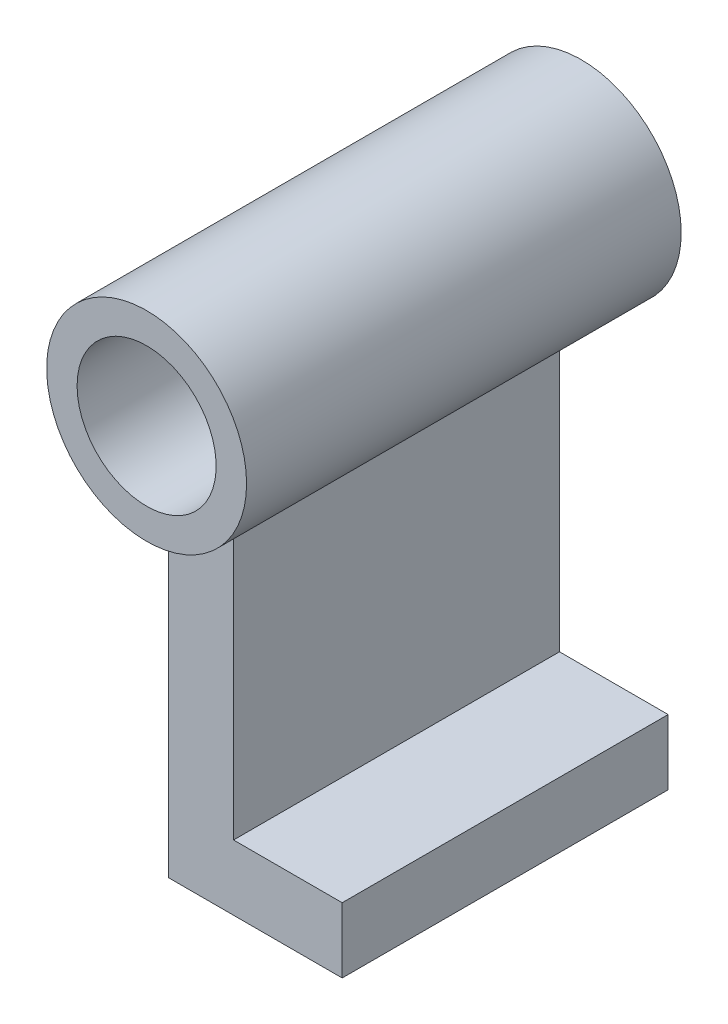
ISO-10303-21;
HEADER;
FILE_DESCRIPTION(('STEP AP214'),'2;1');
FILE_NAME('part.step','',(''),(''),'','','');
FILE_SCHEMA(('AUTOMOTIVE_DESIGN { 1 0 10303 214 1 1 1 1 }'));
ENDSEC;
DATA;
#1=APPLICATION_CONTEXT('core data for automotive mechanical design processes');
#2=APPLICATION_PROTOCOL_DEFINITION('international standard','automotive_design',2000,#1);
#3=PRODUCT_CONTEXT('',#1,'mechanical');
#4=PRODUCT('Part','Part','',(#3));
#5=PRODUCT_RELATED_PRODUCT_CATEGORY('part','',(#4));
#6=PRODUCT_DEFINITION_FORMATION('','',#4);
#7=PRODUCT_DEFINITION_CONTEXT('part definition',#1,'design');
#8=PRODUCT_DEFINITION('design','',#6,#7);
#9=PRODUCT_DEFINITION_SHAPE('','',#8);
#10=(LENGTH_UNIT() NAMED_UNIT(*) SI_UNIT(.MILLI.,.METRE.));
#11=(NAMED_UNIT(*) PLANE_ANGLE_UNIT() SI_UNIT($,.RADIAN.));
#12=(NAMED_UNIT(*) SI_UNIT($,.STERADIAN.) SOLID_ANGLE_UNIT());
#13=UNCERTAINTY_MEASURE_WITH_UNIT(LENGTH_MEASURE(1.E-05),#10,'distance_accuracy_value','');
#14=(GEOMETRIC_REPRESENTATION_CONTEXT(3) GLOBAL_UNCERTAINTY_ASSIGNED_CONTEXT((#13)) GLOBAL_UNIT_ASSIGNED_CONTEXT((#10,
#11,#12)) REPRESENTATION_CONTEXT('',''));
#15=CARTESIAN_POINT('',(0.,0.,0.));
#16=DIRECTION('',(0.,0.,1.));
#17=DIRECTION('',(1.,0.,0.));
#18=AXIS2_PLACEMENT_3D('',#15,#16,#17);
#19=CARTESIAN_POINT('',(0.,0.,50.));
#20=DIRECTION('',(0.,0.,-1.));
#21=DIRECTION('',(-1.,0.,0.));
#22=AXIS2_PLACEMENT_3D('',#19,#20,#21);
#23=CYLINDRICAL_SURFACE('',#22,23.);
#24=DIRECTION('',(0.,0.,-1.));
#25=VECTOR('',#24,1.);
#26=CARTESIAN_POINT('',(-7.5,-21.7428149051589,37.5));
#27=LINE('',#26,#25);
#28=CARTESIAN_POINT('',(-7.5,-21.7428149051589,37.5));
#29=VERTEX_POINT('',#28);
#30=CARTESIAN_POINT('',(-7.5,-21.7428149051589,-37.5));
#31=VERTEX_POINT('',#30);
#32=EDGE_CURVE('E58',#29,#31,#27,.T.);
#33=ORIENTED_EDGE('',*,*,#32,.F.);
#34=CARTESIAN_POINT('',(0.,0.,37.5));
#35=DIRECTION('',(0.,0.,1.));
#36=DIRECTION('',(1.,0.,0.));
#37=AXIS2_PLACEMENT_3D('',#34,#35,#36);
#38=CIRCLE('',#37,23.);
#39=CARTESIAN_POINT('',(7.5,-21.7428149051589,37.5));
#40=VERTEX_POINT('',#39);
#41=EDGE_CURVE('E63',#29,#40,#38,.T.);
#42=ORIENTED_EDGE('',*,*,#41,.T.);
#43=DIRECTION('',(0.,0.,-1.));
#44=VECTOR('',#43,1.);
#45=CARTESIAN_POINT('',(7.5,-21.7428149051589,37.5));
#46=LINE('',#45,#44);
#47=CARTESIAN_POINT('',(7.5,-21.7428149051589,-37.5));
#48=VERTEX_POINT('',#47);
#49=EDGE_CURVE('E124',#40,#48,#46,.T.);
#50=ORIENTED_EDGE('',*,*,#49,.T.);
#51=CARTESIAN_POINT('',(0.,0.,-37.5));
#52=DIRECTION('',(0.,0.,1.));
#53=DIRECTION('',(1.,0.,0.));
#54=AXIS2_PLACEMENT_3D('',#51,#52,#53);
#55=CIRCLE('',#54,23.);
#56=EDGE_CURVE('E125',#31,#48,#55,.T.);
#57=ORIENTED_EDGE('',*,*,#56,.F.);
#58=EDGE_LOOP('',(#33,#42,#50,#57));
#59=FACE_BOUND('',#58,.T.);
#60=CARTESIAN_POINT('',(0.,0.,50.));
#61=DIRECTION('',(0.,0.,1.));
#62=DIRECTION('',(1.,0.,0.));
#63=AXIS2_PLACEMENT_3D('',#60,#61,#62);
#64=CIRCLE('',#63,23.);
#65=CARTESIAN_POINT('',(23.,0.,50.));
#66=VERTEX_POINT('',#65);
#67=EDGE_CURVE('E50',#66,#66,#64,.T.);
#68=ORIENTED_EDGE('',*,*,#67,.F.);
#69=EDGE_LOOP('',(#68));
#70=FACE_BOUND('',#69,.T.);
#71=CARTESIAN_POINT('',(0.,0.,-50.));
#72=DIRECTION('',(0.,0.,1.));
#73=DIRECTION('',(1.,0.,0.));
#74=AXIS2_PLACEMENT_3D('',#71,#72,#73);
#75=CIRCLE('',#74,23.);
#76=CARTESIAN_POINT('',(23.,0.,-50.));
#77=VERTEX_POINT('',#76);
#78=EDGE_CURVE('E147',#77,#77,#75,.T.);
#79=ORIENTED_EDGE('',*,*,#78,.T.);
#80=EDGE_LOOP('',(#79));
#81=FACE_BOUND('',#80,.T.);
#82=ADVANCED_FACE('F42',(#59,#70,#81),#23,.T.);
#83=CARTESIAN_POINT('',(0.,0.,50.));
#84=DIRECTION('',(0.,0.,-1.));
#85=DIRECTION('',(-1.,0.,0.));
#86=AXIS2_PLACEMENT_3D('',#83,#84,#85);
#87=CYLINDRICAL_SURFACE('',#86,16.);
#88=CARTESIAN_POINT('',(0.,0.,50.));
#89=DIRECTION('',(0.,0.,1.));
#90=DIRECTION('',(1.,0.,0.));
#91=AXIS2_PLACEMENT_3D('',#88,#89,#90);
#92=CIRCLE('',#91,16.);
#93=CARTESIAN_POINT('',(-16.,0.,50.));
#94=VERTEX_POINT('',#93);
#95=EDGE_CURVE('E11',#94,#94,#92,.T.);
#96=CARTESIAN_POINT('',(0.,0.,-50.));
#97=DIRECTION('',(0.,0.,1.));
#98=DIRECTION('',(1.,0.,0.));
#99=AXIS2_PLACEMENT_3D('',#96,#97,#98);
#100=CIRCLE('',#99,16.);
#101=CARTESIAN_POINT('',(-16.,0.,-50.));
#102=VERTEX_POINT('',#101);
#103=EDGE_CURVE('E45',#102,#102,#100,.T.);
#104=CARTESIAN_POINT('',(-16.,0.,50.));
#105=CARTESIAN_POINT('',(-16.,0.,48.9583333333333));
#106=CARTESIAN_POINT('',(-16.,0.,47.9166666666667));
#107=CARTESIAN_POINT('',(-16.,0.,45.8333333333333));
#108=CARTESIAN_POINT('',(-16.,0.,44.7916666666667));
#109=CARTESIAN_POINT('',(-16.,0.,42.7083333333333));
#110=CARTESIAN_POINT('',(-16.,0.,41.6666666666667));
#111=CARTESIAN_POINT('',(-16.,0.,39.5833333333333));
#112=CARTESIAN_POINT('',(-16.,0.,38.5416666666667));
#113=CARTESIAN_POINT('',(-16.,0.,36.4583333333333));
#114=CARTESIAN_POINT('',(-16.,0.,35.4166666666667));
#115=CARTESIAN_POINT('',(-16.,0.,33.3333333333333));
#116=CARTESIAN_POINT('',(-16.,0.,32.2916666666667));
#117=CARTESIAN_POINT('',(-16.,0.,30.2083333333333));
#118=CARTESIAN_POINT('',(-16.,0.,29.1666666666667));
#119=CARTESIAN_POINT('',(-16.,0.,27.0833333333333));
#120=CARTESIAN_POINT('',(-16.,0.,26.0416666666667));
#121=CARTESIAN_POINT('',(-16.,0.,23.9583333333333));
#122=CARTESIAN_POINT('',(-16.,0.,22.9166666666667));
#123=CARTESIAN_POINT('',(-16.,0.,20.8333333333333));
#124=CARTESIAN_POINT('',(-16.,0.,19.7916666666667));
#125=CARTESIAN_POINT('',(-16.,0.,17.7083333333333));
#126=CARTESIAN_POINT('',(-16.,0.,16.6666666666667));
#127=CARTESIAN_POINT('',(-16.,0.,14.5833333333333));
#128=CARTESIAN_POINT('',(-16.,0.,13.5416666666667));
#129=CARTESIAN_POINT('',(-16.,0.,11.4583333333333));
#130=CARTESIAN_POINT('',(-16.,0.,10.4166666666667));
#131=CARTESIAN_POINT('',(-16.,0.,8.33333333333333));
#132=CARTESIAN_POINT('',(-16.,0.,7.29166666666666));
#133=CARTESIAN_POINT('',(-16.,0.,5.20833333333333));
#134=CARTESIAN_POINT('',(-16.,0.,4.16666666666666));
#135=CARTESIAN_POINT('',(-16.,0.,2.08333333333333));
#136=CARTESIAN_POINT('',(-16.,0.,1.04166666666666));
#137=CARTESIAN_POINT('',(-16.,0.,-1.04166666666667));
#138=CARTESIAN_POINT('',(-16.,0.,-2.08333333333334));
#139=CARTESIAN_POINT('',(-16.,0.,-4.16666666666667));
#140=CARTESIAN_POINT('',(-16.,0.,-5.20833333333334));
#141=CARTESIAN_POINT('',(-16.,0.,-7.29166666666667));
#142=CARTESIAN_POINT('',(-16.,0.,-8.33333333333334));
#143=CARTESIAN_POINT('',(-16.,0.,-10.4166666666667));
#144=CARTESIAN_POINT('',(-16.,0.,-11.4583333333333));
#145=CARTESIAN_POINT('',(-16.,0.,-13.5416666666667));
#146=CARTESIAN_POINT('',(-16.,0.,-14.5833333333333));
#147=CARTESIAN_POINT('',(-16.,0.,-16.6666666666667));
#148=CARTESIAN_POINT('',(-16.,0.,-17.7083333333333));
#149=CARTESIAN_POINT('',(-16.,0.,-19.7916666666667));
#150=CARTESIAN_POINT('',(-16.,0.,-20.8333333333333));
#151=CARTESIAN_POINT('',(-16.,0.,-22.9166666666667));
#152=CARTESIAN_POINT('',(-16.,0.,-23.9583333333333));
#153=CARTESIAN_POINT('',(-16.,0.,-26.0416666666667));
#154=CARTESIAN_POINT('',(-16.,0.,-27.0833333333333));
#155=CARTESIAN_POINT('',(-16.,0.,-29.1666666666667));
#156=CARTESIAN_POINT('',(-16.,0.,-30.2083333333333));
#157=CARTESIAN_POINT('',(-16.,0.,-32.2916666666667));
#158=CARTESIAN_POINT('',(-16.,0.,-33.3333333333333));
#159=CARTESIAN_POINT('',(-16.,0.,-35.4166666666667));
#160=CARTESIAN_POINT('',(-16.,0.,-36.4583333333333));
#161=CARTESIAN_POINT('',(-16.,0.,-38.5416666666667));
#162=CARTESIAN_POINT('',(-16.,0.,-39.5833333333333));
#163=CARTESIAN_POINT('',(-16.,0.,-41.6666666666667));
#164=CARTESIAN_POINT('',(-16.,0.,-42.7083333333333));
#165=CARTESIAN_POINT('',(-16.,0.,-44.7916666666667));
#166=CARTESIAN_POINT('',(-16.,0.,-45.8333333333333));
#167=CARTESIAN_POINT('',(-16.,0.,-47.9166666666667));
#168=CARTESIAN_POINT('',(-16.,0.,-48.9583333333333));
#169=CARTESIAN_POINT('',(-16.,0.,-50.));
#170=B_SPLINE_CURVE_WITH_KNOTS('',3,(#104,#105,#106,#107,#108,#109,#110,#111,#112,#113,#114,
#115,#116,#117,#118,#119,#120,#121,#122,#123,#124,#125,#126,#127,#128,#129,#130,#131,#132,#133,
#134,#135,#136,#137,#138,#139,#140,#141,#142,#143,#144,#145,#146,#147,#148,#149,#150,#151,#152,
#153,#154,#155,#156,#157,#158,#159,#160,#161,#162,#163,#164,#165,#166,#167,#168,#169),
.UNSPECIFIED.,.F.,.F.,(4,2,2,2,2,2,2,2,2,2,2,2,2,2,2,2,2,2,2,2,2,2,2,2,2,2,2,2,2,2,2,2,4),(0.,
3.125,6.25,9.37499999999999,12.5,15.625,18.75,21.875,25.,28.125,31.25,34.375,37.5,40.625,43.75,
46.875,50.,53.125,56.25,59.375,62.5,65.625,68.75,71.875,75.,78.125,81.25,84.375,87.5,90.625,
93.75,96.875,100.),.UNSPECIFIED.);
#171=EDGE_CURVE('BSEAM157',#94,#102,#170,.T.);
#172=ORIENTED_EDGE('',*,*,#95,.T.);
#173=ORIENTED_EDGE('',*,*,#103,.F.);
#174=ORIENTED_EDGE('',*,*,#171,.T.);
#175=ORIENTED_EDGE('',*,*,#171,.F.);
#176=EDGE_LOOP('',(#172,#174,#173,#175));
#177=FACE_BOUND('',#176,.T.);
#178=ADVANCED_FACE('F157',(#177),#87,.F.);
#179=CARTESIAN_POINT('',(0.,0.,50.));
#180=DIRECTION('',(0.,0.,1.));
#181=DIRECTION('',(1.,0.,0.));
#182=AXIS2_PLACEMENT_3D('',#179,#180,#181);
#183=PLANE('',#182);
#184=ORIENTED_EDGE('',*,*,#67,.T.);
#185=EDGE_LOOP('',(#184));
#186=FACE_BOUND('',#185,.T.);
#187=ORIENTED_EDGE('',*,*,#95,.F.);
#188=EDGE_LOOP('',(#187));
#189=FACE_BOUND('',#188,.T.);
#190=ADVANCED_FACE('F159',(#186,#189),#183,.T.);
#191=CARTESIAN_POINT('',(0.,0.,-50.));
#192=DIRECTION('',(0.,0.,1.));
#193=DIRECTION('',(1.,0.,0.));
#194=AXIS2_PLACEMENT_3D('',#191,#192,#193);
#195=PLANE('',#194);
#196=ORIENTED_EDGE('',*,*,#78,.F.);
#197=EDGE_LOOP('',(#196));
#198=FACE_BOUND('',#197,.T.);
#199=ORIENTED_EDGE('',*,*,#103,.T.);
#200=EDGE_LOOP('',(#199));
#201=FACE_BOUND('',#200,.T.);
#202=ADVANCED_FACE('F155',(#198,#201),#195,.F.);
#203=CARTESIAN_POINT('',(-7.5,0.,37.5));
#204=DIRECTION('',(1.,0.,0.));
#205=DIRECTION('',(0.,0.,-1.));
#206=AXIS2_PLACEMENT_3D('',#203,#204,#205);
#207=PLANE('',#206);
#208=DIRECTION('',(0.,-1.,0.));
#209=VECTOR('',#208,1.);
#210=CARTESIAN_POINT('',(-7.5,0.,-37.5));
#211=LINE('',#210,#209);
#212=CARTESIAN_POINT('',(-7.5,-100.,-37.5));
#213=VERTEX_POINT('',#212);
#214=EDGE_CURVE('E106',#31,#213,#211,.T.);
#215=ORIENTED_EDGE('',*,*,#214,.T.);
#216=DIRECTION('',(0.,0.,-1.));
#217=VECTOR('',#216,1.);
#218=CARTESIAN_POINT('',(-7.5,-100.,37.5));
#219=LINE('',#218,#217);
#220=CARTESIAN_POINT('',(-7.5,-100.,37.5));
#221=VERTEX_POINT('',#220);
#222=EDGE_CURVE('E103',#221,#213,#219,.T.);
#223=ORIENTED_EDGE('',*,*,#222,.F.);
#224=DIRECTION('',(0.,-1.,0.));
#225=VECTOR('',#224,1.);
#226=CARTESIAN_POINT('',(-7.5,0.,37.5));
#227=LINE('',#226,#225);
#228=EDGE_CURVE('E94',#29,#221,#227,.T.);
#229=ORIENTED_EDGE('',*,*,#228,.F.);
#230=ORIENTED_EDGE('',*,*,#32,.T.);
#231=EDGE_LOOP('',(#215,#223,#229,#230));
#232=FACE_BOUND('',#231,.T.);
#233=ADVANCED_FACE('F104',(#232),#207,.F.);
#234=CARTESIAN_POINT('',(0.,-100.,37.5));
#235=DIRECTION('',(0.,-1.,0.));
#236=DIRECTION('',(0.,0.,-1.));
#237=AXIS2_PLACEMENT_3D('',#234,#235,#236);
#238=PLANE('',#237);
#239=DIRECTION('',(-1.,0.,0.));
#240=VECTOR('',#239,1.);
#241=CARTESIAN_POINT('',(0.,-100.,-37.5));
#242=LINE('',#241,#240);
#243=CARTESIAN_POINT('',(32.5,-100.,-37.5));
#244=VERTEX_POINT('',#243);
#245=EDGE_CURVE('E129',#244,#213,#242,.T.);
#246=ORIENTED_EDGE('',*,*,#245,.F.);
#247=DIRECTION('',(0.,0.,-1.));
#248=VECTOR('',#247,1.);
#249=CARTESIAN_POINT('',(32.5,-100.,37.5));
#250=LINE('',#249,#248);
#251=CARTESIAN_POINT('',(32.5,-100.,37.5));
#252=VERTEX_POINT('',#251);
#253=EDGE_CURVE('E110',#252,#244,#250,.T.);
#254=ORIENTED_EDGE('',*,*,#253,.F.);
#255=DIRECTION('',(-1.,0.,0.));
#256=VECTOR('',#255,1.);
#257=CARTESIAN_POINT('',(0.,-100.,37.5));
#258=LINE('',#257,#256);
#259=EDGE_CURVE('E98',#252,#221,#258,.T.);
#260=ORIENTED_EDGE('',*,*,#259,.T.);
#261=ORIENTED_EDGE('',*,*,#222,.T.);
#262=EDGE_LOOP('',(#246,#254,#260,#261));
#263=FACE_BOUND('',#262,.T.);
#264=ADVANCED_FACE('F112',(#263),#238,.T.);
#265=CARTESIAN_POINT('',(32.5,0.,37.5));
#266=DIRECTION('',(-1.,0.,0.));
#267=DIRECTION('',(0.,0.,1.));
#268=AXIS2_PLACEMENT_3D('',#265,#266,#267);
#269=PLANE('',#268);
#270=DIRECTION('',(0.,1.,0.));
#271=VECTOR('',#270,1.);
#272=CARTESIAN_POINT('',(32.5,0.,-37.5));
#273=LINE('',#272,#271);
#274=CARTESIAN_POINT('',(32.5,-85.,-37.5));
#275=VERTEX_POINT('',#274);
#276=EDGE_CURVE('E131',#244,#275,#273,.T.);
#277=ORIENTED_EDGE('',*,*,#276,.T.);
#278=DIRECTION('',(0.,0.,-1.));
#279=VECTOR('',#278,1.);
#280=CARTESIAN_POINT('',(32.5,-85.,37.5));
#281=LINE('',#280,#279);
#282=CARTESIAN_POINT('',(32.5,-85.,37.5));
#283=VERTEX_POINT('',#282);
#284=EDGE_CURVE('E142',#283,#275,#281,.T.);
#285=ORIENTED_EDGE('',*,*,#284,.F.);
#286=DIRECTION('',(0.,1.,0.));
#287=VECTOR('',#286,1.);
#288=CARTESIAN_POINT('',(32.5,0.,37.5));
#289=LINE('',#288,#287);
#290=EDGE_CURVE('E114',#252,#283,#289,.T.);
#291=ORIENTED_EDGE('',*,*,#290,.F.);
#292=ORIENTED_EDGE('',*,*,#253,.T.);
#293=EDGE_LOOP('',(#277,#285,#291,#292));
#294=FACE_BOUND('',#293,.T.);
#295=ADVANCED_FACE('F175',(#294),#269,.F.);
#296=CARTESIAN_POINT('',(0.,-85.,37.5));
#297=DIRECTION('',(0.,-1.,0.));
#298=DIRECTION('',(0.,0.,-1.));
#299=AXIS2_PLACEMENT_3D('',#296,#297,#298);
#300=PLANE('',#299);
#301=DIRECTION('',(-1.,0.,0.));
#302=VECTOR('',#301,1.);
#303=CARTESIAN_POINT('',(0.,-85.,-37.5));
#304=LINE('',#303,#302);
#305=CARTESIAN_POINT('',(7.5,-85.,-37.5));
#306=VERTEX_POINT('',#305);
#307=EDGE_CURVE('E133',#275,#306,#304,.T.);
#308=ORIENTED_EDGE('',*,*,#307,.T.);
#309=DIRECTION('',(0.,0.,-1.));
#310=VECTOR('',#309,1.);
#311=CARTESIAN_POINT('',(7.5,-85.,37.5));
#312=LINE('',#311,#310);
#313=CARTESIAN_POINT('',(7.5,-85.,37.5));
#314=VERTEX_POINT('',#313);
#315=EDGE_CURVE('E140',#314,#306,#312,.T.);
#316=ORIENTED_EDGE('',*,*,#315,.F.);
#317=DIRECTION('',(-1.,0.,0.));
#318=VECTOR('',#317,1.);
#319=CARTESIAN_POINT('',(0.,-85.,37.5));
#320=LINE('',#319,#318);
#321=EDGE_CURVE('E116',#283,#314,#320,.T.);
#322=ORIENTED_EDGE('',*,*,#321,.F.);
#323=ORIENTED_EDGE('',*,*,#284,.T.);
#324=EDGE_LOOP('',(#308,#316,#322,#323));
#325=FACE_BOUND('',#324,.T.);
#326=ADVANCED_FACE('F178',(#325),#300,.F.);
#327=CARTESIAN_POINT('',(7.5,0.,37.5));
#328=DIRECTION('',(1.,0.,0.));
#329=DIRECTION('',(0.,0.,-1.));
#330=AXIS2_PLACEMENT_3D('',#327,#328,#329);
#331=PLANE('',#330);
#332=DIRECTION('',(0.,-1.,0.));
#333=VECTOR('',#332,1.);
#334=CARTESIAN_POINT('',(7.5,0.,-37.5));
#335=LINE('',#334,#333);
#336=EDGE_CURVE('E136',#48,#306,#335,.T.);
#337=ORIENTED_EDGE('',*,*,#336,.F.);
#338=ORIENTED_EDGE('',*,*,#49,.F.);
#339=DIRECTION('',(0.,-1.,0.));
#340=VECTOR('',#339,1.);
#341=CARTESIAN_POINT('',(7.5,0.,37.5));
#342=LINE('',#341,#340);
#343=EDGE_CURVE('E121',#40,#314,#342,.T.);
#344=ORIENTED_EDGE('',*,*,#343,.T.);
#345=ORIENTED_EDGE('',*,*,#315,.T.);
#346=EDGE_LOOP('',(#337,#338,#344,#345));
#347=FACE_BOUND('',#346,.T.);
#348=ADVANCED_FACE('F182',(#347),#331,.T.);
#349=CARTESIAN_POINT('',(0.,0.,37.5));
#350=DIRECTION('',(0.,0.,1.));
#351=DIRECTION('',(1.,0.,0.));
#352=AXIS2_PLACEMENT_3D('',#349,#350,#351);
#353=PLANE('',#352);
#354=ORIENTED_EDGE('',*,*,#41,.F.);
#355=ORIENTED_EDGE('',*,*,#228,.T.);
#356=ORIENTED_EDGE('',*,*,#259,.F.);
#357=ORIENTED_EDGE('',*,*,#290,.T.);
#358=ORIENTED_EDGE('',*,*,#321,.T.);
#359=ORIENTED_EDGE('',*,*,#343,.F.);
#360=EDGE_LOOP('',(#354,#355,#356,#357,#358,#359));
#361=FACE_BOUND('',#360,.T.);
#362=ADVANCED_FACE('F96',(#361),#353,.T.);
#363=CARTESIAN_POINT('',(0.,0.,-37.5));
#364=DIRECTION('',(0.,0.,1.));
#365=DIRECTION('',(1.,0.,0.));
#366=AXIS2_PLACEMENT_3D('',#363,#364,#365);
#367=PLANE('',#366);
#368=ORIENTED_EDGE('',*,*,#56,.T.);
#369=ORIENTED_EDGE('',*,*,#336,.T.);
#370=ORIENTED_EDGE('',*,*,#307,.F.);
#371=ORIENTED_EDGE('',*,*,#276,.F.);
#372=ORIENTED_EDGE('',*,*,#245,.T.);
#373=ORIENTED_EDGE('',*,*,#214,.F.);
#374=EDGE_LOOP('',(#368,#369,#370,#371,#372,#373));
#375=FACE_BOUND('',#374,.T.);
#376=ADVANCED_FACE('F187',(#375),#367,.F.);
#377=CLOSED_SHELL('',(#82,#178,#190,#202,#233,#264,#295,#326,#348,#362,#376));
#378=MANIFOLD_SOLID_BREP('B2',#377);
#379=ADVANCED_BREP_SHAPE_REPRESENTATION('',(#18,#378),#14);
#380=SHAPE_DEFINITION_REPRESENTATION(#9,#379);
ENDSEC;
END-ISO-10303-21;
